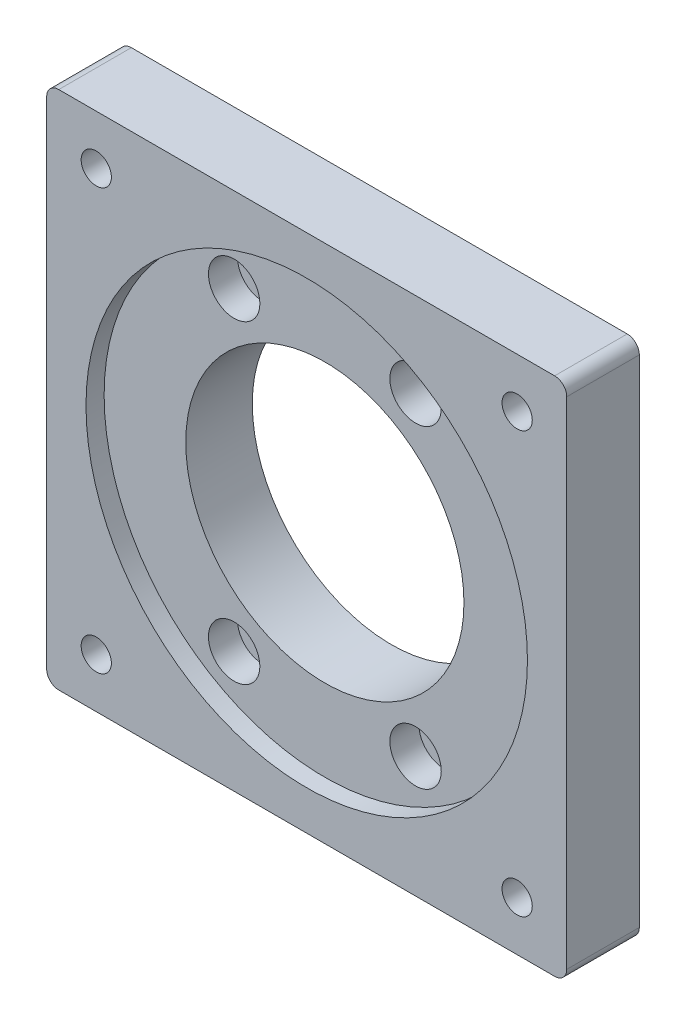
ISO-10303-21;
HEADER;
FILE_DESCRIPTION(('STEP AP214'),'2;1');
FILE_NAME('part.step','',(''),(''),'','','');
FILE_SCHEMA(('AUTOMOTIVE_DESIGN { 1 0 10303 214 1 1 1 1 }'));
ENDSEC;
DATA;
#1=APPLICATION_CONTEXT('core data for automotive mechanical design processes');
#2=APPLICATION_PROTOCOL_DEFINITION('international standard','automotive_design',2000,#1);
#3=PRODUCT_CONTEXT('',#1,'mechanical');
#4=PRODUCT('Part','Part','',(#3));
#5=PRODUCT_RELATED_PRODUCT_CATEGORY('part','',(#4));
#6=PRODUCT_DEFINITION_FORMATION('','',#4);
#7=PRODUCT_DEFINITION_CONTEXT('part definition',#1,'design');
#8=PRODUCT_DEFINITION('design','',#6,#7);
#9=PRODUCT_DEFINITION_SHAPE('','',#8);
#10=(LENGTH_UNIT() NAMED_UNIT(*) SI_UNIT(.MILLI.,.METRE.));
#11=(NAMED_UNIT(*) PLANE_ANGLE_UNIT() SI_UNIT($,.RADIAN.));
#12=(NAMED_UNIT(*) SI_UNIT($,.STERADIAN.) SOLID_ANGLE_UNIT());
#13=UNCERTAINTY_MEASURE_WITH_UNIT(LENGTH_MEASURE(1.E-05),#10,'distance_accuracy_value','');
#14=(GEOMETRIC_REPRESENTATION_CONTEXT(3) GLOBAL_UNCERTAINTY_ASSIGNED_CONTEXT((#13)) GLOBAL_UNIT_ASSIGNED_CONTEXT((#10,
#11,#12)) REPRESENTATION_CONTEXT('',''));
#15=CARTESIAN_POINT('',(0.,0.,0.));
#16=DIRECTION('',(0.,0.,1.));
#17=DIRECTION('',(1.,0.,0.));
#18=AXIS2_PLACEMENT_3D('',#15,#16,#17);
#19=CARTESIAN_POINT('',(0.,0.,0.));
#20=DIRECTION('',(0.,0.,-1.));
#21=DIRECTION('',(-1.,0.,0.));
#22=AXIS2_PLACEMENT_3D('',#19,#20,#21);
#23=PLANE('',#22);
#24=CARTESIAN_POINT('',(-34.8,-34.8,0.));
#25=DIRECTION('',(0.,0.,-1.));
#26=DIRECTION('',(-1.,0.,0.));
#27=AXIS2_PLACEMENT_3D('',#24,#25,#26);
#28=CIRCLE('',#27,2.49999999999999);
#29=CARTESIAN_POINT('',(-37.3,-34.8,0.));
#30=VERTEX_POINT('',#29);
#31=EDGE_CURVE('E265',#30,#30,#28,.T.);
#32=ORIENTED_EDGE('',*,*,#31,.F.);
#33=EDGE_LOOP('',(#32));
#34=FACE_BOUND('',#33,.T.);
#35=CARTESIAN_POINT('',(-34.8,34.8,0.));
#36=DIRECTION('',(0.,0.,-1.));
#37=DIRECTION('',(-1.,0.,0.));
#38=AXIS2_PLACEMENT_3D('',#35,#36,#37);
#39=CIRCLE('',#38,2.49999999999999);
#40=CARTESIAN_POINT('',(-37.3,34.8,0.));
#41=VERTEX_POINT('',#40);
#42=EDGE_CURVE('E259',#41,#41,#39,.T.);
#43=ORIENTED_EDGE('',*,*,#42,.F.);
#44=EDGE_LOOP('',(#43));
#45=FACE_BOUND('',#44,.T.);
#46=CARTESIAN_POINT('',(34.8,34.8,0.));
#47=DIRECTION('',(0.,0.,-1.));
#48=DIRECTION('',(-1.,0.,0.));
#49=AXIS2_PLACEMENT_3D('',#46,#47,#48);
#50=CIRCLE('',#49,2.49999999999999);
#51=CARTESIAN_POINT('',(32.3,34.8,0.));
#52=VERTEX_POINT('',#51);
#53=EDGE_CURVE('E253',#52,#52,#50,.T.);
#54=ORIENTED_EDGE('',*,*,#53,.F.);
#55=EDGE_LOOP('',(#54));
#56=FACE_BOUND('',#55,.T.);
#57=CARTESIAN_POINT('',(34.8,-34.8,0.));
#58=DIRECTION('',(0.,0.,-1.));
#59=DIRECTION('',(-1.,0.,0.));
#60=AXIS2_PLACEMENT_3D('',#57,#58,#59);
#61=CIRCLE('',#60,2.49999999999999);
#62=CARTESIAN_POINT('',(32.3,-34.8,0.));
#63=VERTEX_POINT('',#62);
#64=EDGE_CURVE('E247',#63,#63,#61,.T.);
#65=ORIENTED_EDGE('',*,*,#64,.F.);
#66=EDGE_LOOP('',(#65));
#67=FACE_BOUND('',#66,.T.);
#68=DIRECTION('',(0.,-1.,0.));
#69=VECTOR('',#68,1.);
#70=CARTESIAN_POINT('',(-43.,-43.,0.));
#71=LINE('',#70,#69);
#72=CARTESIAN_POINT('',(-43.,41.,0.));
#73=VERTEX_POINT('',#72);
#74=CARTESIAN_POINT('',(-43.,-41.,0.));
#75=VERTEX_POINT('',#74);
#76=EDGE_CURVE('E122',#73,#75,#71,.T.);
#77=ORIENTED_EDGE('',*,*,#76,.F.);
#78=CARTESIAN_POINT('',(-41.,41.,0.));
#79=DIRECTION('',(0.,0.,-1.));
#80=DIRECTION('',(-1.,0.,0.));
#81=AXIS2_PLACEMENT_3D('',#78,#79,#80);
#82=CIRCLE('',#81,2.);
#83=CARTESIAN_POINT('',(-41.,43.,0.));
#84=VERTEX_POINT('',#83);
#85=EDGE_CURVE('E105',#73,#84,#82,.T.);
#86=ORIENTED_EDGE('',*,*,#85,.T.);
#87=DIRECTION('',(-1.,0.,0.));
#88=VECTOR('',#87,1.);
#89=CARTESIAN_POINT('',(-43.,43.,0.));
#90=LINE('',#89,#88);
#91=CARTESIAN_POINT('',(41.,43.,0.));
#92=VERTEX_POINT('',#91);
#93=EDGE_CURVE('E131',#92,#84,#90,.T.);
#94=ORIENTED_EDGE('',*,*,#93,.F.);
#95=CARTESIAN_POINT('',(41.,41.,0.));
#96=DIRECTION('',(0.,0.,-1.));
#97=DIRECTION('',(-1.,0.,0.));
#98=AXIS2_PLACEMENT_3D('',#95,#96,#97);
#99=CIRCLE('',#98,2.);
#100=CARTESIAN_POINT('',(43.,41.,0.));
#101=VERTEX_POINT('',#100);
#102=EDGE_CURVE('E125',#92,#101,#99,.T.);
#103=ORIENTED_EDGE('',*,*,#102,.T.);
#104=DIRECTION('',(0.,1.,0.));
#105=VECTOR('',#104,1.);
#106=CARTESIAN_POINT('',(43.,-43.,0.));
#107=LINE('',#106,#105);
#108=CARTESIAN_POINT('',(43.,-41.,0.));
#109=VERTEX_POINT('',#108);
#110=EDGE_CURVE('E135',#109,#101,#107,.T.);
#111=ORIENTED_EDGE('',*,*,#110,.F.);
#112=CARTESIAN_POINT('',(41.,-41.,0.));
#113=DIRECTION('',(0.,0.,-1.));
#114=DIRECTION('',(-1.,0.,0.));
#115=AXIS2_PLACEMENT_3D('',#112,#113,#114);
#116=CIRCLE('',#115,2.);
#117=CARTESIAN_POINT('',(41.,-43.,0.));
#118=VERTEX_POINT('',#117);
#119=EDGE_CURVE('E166',#109,#118,#116,.T.);
#120=ORIENTED_EDGE('',*,*,#119,.T.);
#121=DIRECTION('',(1.,0.,0.));
#122=VECTOR('',#121,1.);
#123=CARTESIAN_POINT('',(-43.,-43.,0.));
#124=LINE('',#123,#122);
#125=CARTESIAN_POINT('',(-41.,-43.,0.));
#126=VERTEX_POINT('',#125);
#127=EDGE_CURVE('E130',#126,#118,#124,.T.);
#128=ORIENTED_EDGE('',*,*,#127,.F.);
#129=CARTESIAN_POINT('',(-41.,-41.,0.));
#130=DIRECTION('',(0.,0.,-1.));
#131=DIRECTION('',(-1.,0.,0.));
#132=AXIS2_PLACEMENT_3D('',#129,#130,#131);
#133=CIRCLE('',#132,2.);
#134=EDGE_CURVE('E116',#126,#75,#133,.T.);
#135=ORIENTED_EDGE('',*,*,#134,.T.);
#136=EDGE_LOOP('',(#77,#86,#94,#103,#111,#120,#128,#135));
#137=FACE_BOUND('',#136,.T.);
#138=CARTESIAN_POINT('',(-15.,25.9807621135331,0.));
#139=DIRECTION('',(0.,0.,1.));
#140=DIRECTION('',(1.,0.,0.));
#141=AXIS2_PLACEMENT_3D('',#138,#139,#140);
#142=CIRCLE('',#141,2.25);
#143=CARTESIAN_POINT('',(-12.75,25.9807621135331,0.));
#144=VERTEX_POINT('',#143);
#145=EDGE_CURVE('E208',#144,#144,#142,.T.);
#146=ORIENTED_EDGE('',*,*,#145,.T.);
#147=EDGE_LOOP('',(#146));
#148=FACE_BOUND('',#147,.T.);
#149=CARTESIAN_POINT('',(15.,25.9807621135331,0.));
#150=DIRECTION('',(0.,0.,1.));
#151=DIRECTION('',(1.,0.,0.));
#152=AXIS2_PLACEMENT_3D('',#149,#150,#151);
#153=CIRCLE('',#152,2.25);
#154=CARTESIAN_POINT('',(17.25,25.9807621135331,0.));
#155=VERTEX_POINT('',#154);
#156=EDGE_CURVE('E213',#155,#155,#153,.T.);
#157=ORIENTED_EDGE('',*,*,#156,.T.);
#158=EDGE_LOOP('',(#157));
#159=FACE_BOUND('',#158,.T.);
#160=CARTESIAN_POINT('',(15.,-25.9807621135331,0.));
#161=DIRECTION('',(0.,0.,1.));
#162=DIRECTION('',(1.,0.,0.));
#163=AXIS2_PLACEMENT_3D('',#160,#161,#162);
#164=CIRCLE('',#163,2.25);
#165=CARTESIAN_POINT('',(17.25,-25.9807621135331,0.));
#166=VERTEX_POINT('',#165);
#167=EDGE_CURVE('E216',#166,#166,#164,.T.);
#168=ORIENTED_EDGE('',*,*,#167,.T.);
#169=EDGE_LOOP('',(#168));
#170=FACE_BOUND('',#169,.T.);
#171=CARTESIAN_POINT('',(-15.,-25.9807621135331,0.));
#172=DIRECTION('',(0.,0.,1.));
#173=DIRECTION('',(1.,0.,0.));
#174=AXIS2_PLACEMENT_3D('',#171,#172,#173);
#175=CIRCLE('',#174,2.25);
#176=CARTESIAN_POINT('',(-12.75,-25.9807621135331,0.));
#177=VERTEX_POINT('',#176);
#178=EDGE_CURVE('E146',#177,#177,#175,.T.);
#179=ORIENTED_EDGE('',*,*,#178,.T.);
#180=EDGE_LOOP('',(#179));
#181=FACE_BOUND('',#180,.T.);
#182=CARTESIAN_POINT('',(0.,0.,0.));
#183=DIRECTION('',(0.,0.,-1.));
#184=DIRECTION('',(-1.,0.,0.));
#185=AXIS2_PLACEMENT_3D('',#182,#183,#184);
#186=CIRCLE('',#185,25.);
#187=CARTESIAN_POINT('',(-25.,0.,0.));
#188=VERTEX_POINT('',#187);
#189=EDGE_CURVE('E239',#188,#188,#186,.T.);
#190=ORIENTED_EDGE('',*,*,#189,.F.);
#191=EDGE_LOOP('',(#190));
#192=FACE_BOUND('',#191,.T.);
#193=ADVANCED_FACE('F38',(#34,#45,#56,#67,#137,#148,#159,#170,#181,#192),#23,.T.);
#194=CARTESIAN_POINT('',(-15.,-25.9807621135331,0.));
#195=DIRECTION('',(0.,0.,1.));
#196=DIRECTION('',(1.,0.,0.));
#197=AXIS2_PLACEMENT_3D('',#194,#195,#196);
#198=CYLINDRICAL_SURFACE('',#197,2.25);
#199=ORIENTED_EDGE('',*,*,#178,.F.);
#200=EDGE_LOOP('',(#199));
#201=FACE_BOUND('',#200,.T.);
#202=CARTESIAN_POINT('',(-15.,-25.9807621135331,4.2));
#203=DIRECTION('',(0.,0.,1.));
#204=DIRECTION('',(1.,0.,0.));
#205=AXIS2_PLACEMENT_3D('',#202,#203,#204);
#206=CIRCLE('',#205,2.25);
#207=CARTESIAN_POINT('',(-12.75,-25.9807621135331,4.2));
#208=VERTEX_POINT('',#207);
#209=EDGE_CURVE('E158',#208,#208,#206,.F.);
#210=ORIENTED_EDGE('',*,*,#209,.F.);
#211=EDGE_LOOP('',(#210));
#212=FACE_BOUND('',#211,.T.);
#213=ADVANCED_FACE('F303',(#201,#212),#198,.F.);
#214=CARTESIAN_POINT('',(15.,-25.9807621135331,0.));
#215=DIRECTION('',(0.,0.,1.));
#216=DIRECTION('',(1.,0.,0.));
#217=AXIS2_PLACEMENT_3D('',#214,#215,#216);
#218=CYLINDRICAL_SURFACE('',#217,2.25);
#219=ORIENTED_EDGE('',*,*,#167,.F.);
#220=EDGE_LOOP('',(#219));
#221=FACE_BOUND('',#220,.T.);
#222=CARTESIAN_POINT('',(15.,-25.9807621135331,4.2));
#223=DIRECTION('',(0.,0.,1.));
#224=DIRECTION('',(1.,0.,0.));
#225=AXIS2_PLACEMENT_3D('',#222,#223,#224);
#226=CIRCLE('',#225,2.25);
#227=CARTESIAN_POINT('',(17.25,-25.9807621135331,4.2));
#228=VERTEX_POINT('',#227);
#229=EDGE_CURVE('E153',#228,#228,#226,.F.);
#230=ORIENTED_EDGE('',*,*,#229,.F.);
#231=EDGE_LOOP('',(#230));
#232=FACE_BOUND('',#231,.T.);
#233=ADVANCED_FACE('F309',(#221,#232),#218,.F.);
#234=CARTESIAN_POINT('',(15.,25.9807621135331,0.));
#235=DIRECTION('',(0.,0.,1.));
#236=DIRECTION('',(1.,0.,0.));
#237=AXIS2_PLACEMENT_3D('',#234,#235,#236);
#238=CYLINDRICAL_SURFACE('',#237,2.25);
#239=ORIENTED_EDGE('',*,*,#156,.F.);
#240=EDGE_LOOP('',(#239));
#241=FACE_BOUND('',#240,.T.);
#242=CARTESIAN_POINT('',(15.,25.9807621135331,4.2));
#243=DIRECTION('',(0.,0.,1.));
#244=DIRECTION('',(1.,0.,0.));
#245=AXIS2_PLACEMENT_3D('',#242,#243,#244);
#246=CIRCLE('',#245,2.25);
#247=CARTESIAN_POINT('',(17.25,25.9807621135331,4.2));
#248=VERTEX_POINT('',#247);
#249=EDGE_CURVE('E148',#248,#248,#246,.F.);
#250=ORIENTED_EDGE('',*,*,#249,.F.);
#251=EDGE_LOOP('',(#250));
#252=FACE_BOUND('',#251,.T.);
#253=ADVANCED_FACE('F382',(#241,#252),#238,.F.);
#254=CARTESIAN_POINT('',(-15.,25.9807621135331,0.));
#255=DIRECTION('',(0.,0.,1.));
#256=DIRECTION('',(1.,0.,0.));
#257=AXIS2_PLACEMENT_3D('',#254,#255,#256);
#258=CYLINDRICAL_SURFACE('',#257,2.25);
#259=ORIENTED_EDGE('',*,*,#145,.F.);
#260=EDGE_LOOP('',(#259));
#261=FACE_BOUND('',#260,.T.);
#262=CARTESIAN_POINT('',(-15.,25.9807621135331,4.2));
#263=DIRECTION('',(0.,0.,1.));
#264=DIRECTION('',(1.,0.,0.));
#265=AXIS2_PLACEMENT_3D('',#262,#263,#264);
#266=CIRCLE('',#265,2.25);
#267=CARTESIAN_POINT('',(-12.75,25.9807621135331,4.2));
#268=VERTEX_POINT('',#267);
#269=EDGE_CURVE('E143',#268,#268,#266,.F.);
#270=ORIENTED_EDGE('',*,*,#269,.F.);
#271=EDGE_LOOP('',(#270));
#272=FACE_BOUND('',#271,.T.);
#273=ADVANCED_FACE('F386',(#261,#272),#258,.F.);
#274=CARTESIAN_POINT('',(0.,0.,12.));
#275=DIRECTION('',(0.,0.,-1.));
#276=DIRECTION('',(-1.,0.,0.));
#277=AXIS2_PLACEMENT_3D('',#274,#275,#276);
#278=CYLINDRICAL_SURFACE('',#277,23.);
#279=CARTESIAN_POINT('',(0.,0.,9.));
#280=DIRECTION('',(0.,0.,1.));
#281=DIRECTION('',(1.,0.,0.));
#282=AXIS2_PLACEMENT_3D('',#279,#280,#281);
#283=CIRCLE('',#282,23.);
#284=CARTESIAN_POINT('',(23.,0.,9.));
#285=VERTEX_POINT('',#284);
#286=EDGE_CURVE('E139',#285,#285,#283,.T.);
#287=ORIENTED_EDGE('',*,*,#286,.T.);
#288=EDGE_LOOP('',(#287));
#289=FACE_BOUND('',#288,.T.);
#290=CARTESIAN_POINT('',(0.,0.,-2.));
#291=DIRECTION('',(0.,0.,-1.));
#292=DIRECTION('',(-1.,0.,0.));
#293=AXIS2_PLACEMENT_3D('',#290,#291,#292);
#294=CIRCLE('',#293,23.);
#295=CARTESIAN_POINT('',(-23.,0.,-2.));
#296=VERTEX_POINT('',#295);
#297=EDGE_CURVE('E242',#296,#296,#294,.T.);
#298=ORIENTED_EDGE('',*,*,#297,.T.);
#299=EDGE_LOOP('',(#298));
#300=FACE_BOUND('',#299,.T.);
#301=ADVANCED_FACE('F276',(#289,#300),#278,.F.);
#302=CARTESIAN_POINT('',(0.,0.,12.));
#303=DIRECTION('',(0.,0.,-1.));
#304=DIRECTION('',(-1.,0.,0.));
#305=AXIS2_PLACEMENT_3D('',#302,#303,#304);
#306=PLANE('',#305);
#307=CARTESIAN_POINT('',(-34.8,-34.8,12.));
#308=DIRECTION('',(0.,0.,1.));
#309=DIRECTION('',(1.,0.,0.));
#310=AXIS2_PLACEMENT_3D('',#307,#308,#309);
#311=CIRCLE('',#310,2.49999999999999);
#312=CARTESIAN_POINT('',(-32.3,-34.8,12.));
#313=VERTEX_POINT('',#312);
#314=EDGE_CURVE('E268',#313,#313,#311,.T.);
#315=ORIENTED_EDGE('',*,*,#314,.F.);
#316=EDGE_LOOP('',(#315));
#317=FACE_BOUND('',#316,.T.);
#318=CARTESIAN_POINT('',(-34.8,34.8,12.));
#319=DIRECTION('',(0.,0.,1.));
#320=DIRECTION('',(1.,0.,0.));
#321=AXIS2_PLACEMENT_3D('',#318,#319,#320);
#322=CIRCLE('',#321,2.49999999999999);
#323=CARTESIAN_POINT('',(-32.3,34.8,12.));
#324=VERTEX_POINT('',#323);
#325=EDGE_CURVE('E262',#324,#324,#322,.T.);
#326=ORIENTED_EDGE('',*,*,#325,.F.);
#327=EDGE_LOOP('',(#326));
#328=FACE_BOUND('',#327,.T.);
#329=CARTESIAN_POINT('',(34.8,34.8,12.));
#330=DIRECTION('',(0.,0.,1.));
#331=DIRECTION('',(1.,0.,0.));
#332=AXIS2_PLACEMENT_3D('',#329,#330,#331);
#333=CIRCLE('',#332,2.49999999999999);
#334=CARTESIAN_POINT('',(37.3,34.8,12.));
#335=VERTEX_POINT('',#334);
#336=EDGE_CURVE('E256',#335,#335,#333,.T.);
#337=ORIENTED_EDGE('',*,*,#336,.F.);
#338=EDGE_LOOP('',(#337));
#339=FACE_BOUND('',#338,.T.);
#340=CARTESIAN_POINT('',(34.8,-34.8,12.));
#341=DIRECTION('',(0.,0.,1.));
#342=DIRECTION('',(1.,0.,0.));
#343=AXIS2_PLACEMENT_3D('',#340,#341,#342);
#344=CIRCLE('',#343,2.49999999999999);
#345=CARTESIAN_POINT('',(37.3,-34.8,12.));
#346=VERTEX_POINT('',#345);
#347=EDGE_CURVE('E250',#346,#346,#344,.T.);
#348=ORIENTED_EDGE('',*,*,#347,.F.);
#349=EDGE_LOOP('',(#348));
#350=FACE_BOUND('',#349,.T.);
#351=CARTESIAN_POINT('',(0.,0.,12.));
#352=DIRECTION('',(0.,0.,1.));
#353=DIRECTION('',(1.,0.,0.));
#354=AXIS2_PLACEMENT_3D('',#351,#352,#353);
#355=CIRCLE('',#354,36.5);
#356=CARTESIAN_POINT('',(36.5,0.,12.));
#357=VERTEX_POINT('',#356);
#358=EDGE_CURVE('E205',#357,#357,#355,.T.);
#359=ORIENTED_EDGE('',*,*,#358,.F.);
#360=EDGE_LOOP('',(#359));
#361=FACE_BOUND('',#360,.T.);
#362=DIRECTION('',(-1.,0.,0.));
#363=VECTOR('',#362,1.);
#364=CARTESIAN_POINT('',(-43.,43.,12.));
#365=LINE('',#364,#363);
#366=CARTESIAN_POINT('',(41.,43.,12.));
#367=VERTEX_POINT('',#366);
#368=CARTESIAN_POINT('',(-41.,43.,12.));
#369=VERTEX_POINT('',#368);
#370=EDGE_CURVE('E196',#367,#369,#365,.T.);
#371=ORIENTED_EDGE('',*,*,#370,.T.);
#372=CARTESIAN_POINT('',(-41.,41.,12.));
#373=DIRECTION('',(0.,0.,-1.));
#374=DIRECTION('',(-1.,0.,0.));
#375=AXIS2_PLACEMENT_3D('',#372,#373,#374);
#376=CIRCLE('',#375,2.);
#377=CARTESIAN_POINT('',(-43.,41.,12.));
#378=VERTEX_POINT('',#377);
#379=EDGE_CURVE('E177',#369,#378,#376,.F.);
#380=ORIENTED_EDGE('',*,*,#379,.T.);
#381=DIRECTION('',(0.,-1.,0.));
#382=VECTOR('',#381,1.);
#383=CARTESIAN_POINT('',(-43.,-43.,12.));
#384=LINE('',#383,#382);
#385=CARTESIAN_POINT('',(-43.,-41.,12.));
#386=VERTEX_POINT('',#385);
#387=EDGE_CURVE('E124',#378,#386,#384,.T.);
#388=ORIENTED_EDGE('',*,*,#387,.T.);
#389=CARTESIAN_POINT('',(-41.,-41.,12.));
#390=DIRECTION('',(0.,0.,-1.));
#391=DIRECTION('',(-1.,0.,0.));
#392=AXIS2_PLACEMENT_3D('',#389,#390,#391);
#393=CIRCLE('',#392,2.);
#394=CARTESIAN_POINT('',(-41.,-43.,12.));
#395=VERTEX_POINT('',#394);
#396=EDGE_CURVE('E60',#386,#395,#393,.F.);
#397=ORIENTED_EDGE('',*,*,#396,.T.);
#398=DIRECTION('',(1.,0.,0.));
#399=VECTOR('',#398,1.);
#400=CARTESIAN_POINT('',(-43.,-43.,12.));
#401=LINE('',#400,#399);
#402=CARTESIAN_POINT('',(41.,-43.,12.));
#403=VERTEX_POINT('',#402);
#404=EDGE_CURVE('E163',#395,#403,#401,.T.);
#405=ORIENTED_EDGE('',*,*,#404,.T.);
#406=CARTESIAN_POINT('',(41.,-41.,12.));
#407=DIRECTION('',(0.,0.,-1.));
#408=DIRECTION('',(-1.,0.,0.));
#409=AXIS2_PLACEMENT_3D('',#406,#407,#408);
#410=CIRCLE('',#409,2.);
#411=CARTESIAN_POINT('',(43.,-41.,12.));
#412=VERTEX_POINT('',#411);
#413=EDGE_CURVE('E174',#403,#412,#410,.F.);
#414=ORIENTED_EDGE('',*,*,#413,.T.);
#415=DIRECTION('',(0.,1.,0.));
#416=VECTOR('',#415,1.);
#417=CARTESIAN_POINT('',(43.,-43.,12.));
#418=LINE('',#417,#416);
#419=CARTESIAN_POINT('',(43.,41.,12.));
#420=VERTEX_POINT('',#419);
#421=EDGE_CURVE('E133',#412,#420,#418,.T.);
#422=ORIENTED_EDGE('',*,*,#421,.T.);
#423=CARTESIAN_POINT('',(41.,41.,12.));
#424=DIRECTION('',(0.,0.,-1.));
#425=DIRECTION('',(-1.,0.,0.));
#426=AXIS2_PLACEMENT_3D('',#423,#424,#425);
#427=CIRCLE('',#426,2.);
#428=EDGE_CURVE('E172',#420,#367,#427,.F.);
#429=ORIENTED_EDGE('',*,*,#428,.T.);
#430=EDGE_LOOP('',(#371,#380,#388,#397,#405,#414,#422,#429));
#431=FACE_BOUND('',#430,.T.);
#432=ADVANCED_FACE('F193',(#317,#328,#339,#350,#361,#431),#306,.F.);
#433=CARTESIAN_POINT('',(43.,-43.,12.));
#434=DIRECTION('',(-1.,0.,0.));
#435=DIRECTION('',(0.,0.,1.));
#436=AXIS2_PLACEMENT_3D('',#433,#434,#435);
#437=PLANE('',#436);
#438=ORIENTED_EDGE('',*,*,#421,.F.);
#439=DIRECTION('',(0.,0.,-1.));
#440=VECTOR('',#439,1.);
#441=CARTESIAN_POINT('',(43.,-41.,12.));
#442=LINE('',#441,#440);
#443=EDGE_CURVE('E11',#412,#109,#442,.T.);
#444=ORIENTED_EDGE('',*,*,#443,.T.);
#445=ORIENTED_EDGE('',*,*,#110,.T.);
#446=DIRECTION('',(0.,0.,-1.));
#447=VECTOR('',#446,1.);
#448=CARTESIAN_POINT('',(43.,41.,12.));
#449=LINE('',#448,#447);
#450=EDGE_CURVE('E46',#101,#420,#449,.F.);
#451=ORIENTED_EDGE('',*,*,#450,.T.);
#452=EDGE_LOOP('',(#438,#444,#445,#451));
#453=FACE_BOUND('',#452,.T.);
#454=ADVANCED_FACE('F187',(#453),#437,.F.);
#455=CARTESIAN_POINT('',(-43.,43.,12.));
#456=DIRECTION('',(0.,-1.,0.));
#457=DIRECTION('',(0.,0.,-1.));
#458=AXIS2_PLACEMENT_3D('',#455,#456,#457);
#459=PLANE('',#458);
#460=ORIENTED_EDGE('',*,*,#93,.T.);
#461=DIRECTION('',(0.,0.,-1.));
#462=VECTOR('',#461,1.);
#463=CARTESIAN_POINT('',(-41.,43.,12.));
#464=LINE('',#463,#462);
#465=EDGE_CURVE('E110',#84,#369,#464,.F.);
#466=ORIENTED_EDGE('',*,*,#465,.T.);
#467=ORIENTED_EDGE('',*,*,#370,.F.);
#468=DIRECTION('',(0.,0.,-1.));
#469=VECTOR('',#468,1.);
#470=CARTESIAN_POINT('',(41.,43.,12.));
#471=LINE('',#470,#469);
#472=EDGE_CURVE('E115',#367,#92,#471,.T.);
#473=ORIENTED_EDGE('',*,*,#472,.T.);
#474=EDGE_LOOP('',(#460,#466,#467,#473));
#475=FACE_BOUND('',#474,.T.);
#476=ADVANCED_FACE('F200',(#475),#459,.F.);
#477=CARTESIAN_POINT('',(-43.,-43.,12.));
#478=DIRECTION('',(1.,0.,0.));
#479=DIRECTION('',(0.,0.,-1.));
#480=AXIS2_PLACEMENT_3D('',#477,#478,#479);
#481=PLANE('',#480);
#482=ORIENTED_EDGE('',*,*,#387,.F.);
#483=DIRECTION('',(0.,0.,-1.));
#484=VECTOR('',#483,1.);
#485=CARTESIAN_POINT('',(-43.,41.,12.));
#486=LINE('',#485,#484);
#487=EDGE_CURVE('E109',#378,#73,#486,.T.);
#488=ORIENTED_EDGE('',*,*,#487,.T.);
#489=ORIENTED_EDGE('',*,*,#76,.T.);
#490=DIRECTION('',(0.,0.,-1.));
#491=VECTOR('',#490,1.);
#492=CARTESIAN_POINT('',(-43.,-41.,12.));
#493=LINE('',#492,#491);
#494=EDGE_CURVE('E126',#75,#386,#493,.F.);
#495=ORIENTED_EDGE('',*,*,#494,.T.);
#496=EDGE_LOOP('',(#482,#488,#489,#495));
#497=FACE_BOUND('',#496,.T.);
#498=ADVANCED_FACE('F121',(#497),#481,.F.);
#499=CARTESIAN_POINT('',(-43.,-43.,12.));
#500=DIRECTION('',(0.,1.,0.));
#501=DIRECTION('',(0.,0.,1.));
#502=AXIS2_PLACEMENT_3D('',#499,#500,#501);
#503=PLANE('',#502);
#504=ORIENTED_EDGE('',*,*,#404,.F.);
#505=DIRECTION('',(0.,0.,-1.));
#506=VECTOR('',#505,1.);
#507=CARTESIAN_POINT('',(-41.,-43.,12.));
#508=LINE('',#507,#506);
#509=EDGE_CURVE('E180',#395,#126,#508,.T.);
#510=ORIENTED_EDGE('',*,*,#509,.T.);
#511=ORIENTED_EDGE('',*,*,#127,.T.);
#512=DIRECTION('',(0.,0.,-1.));
#513=VECTOR('',#512,1.);
#514=CARTESIAN_POINT('',(41.,-43.,12.));
#515=LINE('',#514,#513);
#516=EDGE_CURVE('E53',#118,#403,#515,.F.);
#517=ORIENTED_EDGE('',*,*,#516,.T.);
#518=EDGE_LOOP('',(#504,#510,#511,#517));
#519=FACE_BOUND('',#518,.T.);
#520=ADVANCED_FACE('F289',(#519),#503,.F.);
#521=CARTESIAN_POINT('',(0.,0.,9.));
#522=DIRECTION('',(0.,0.,1.));
#523=DIRECTION('',(1.,0.,0.));
#524=AXIS2_PLACEMENT_3D('',#521,#522,#523);
#525=CYLINDRICAL_SURFACE('',#524,36.5);
#526=CARTESIAN_POINT('',(0.,0.,9.));
#527=DIRECTION('',(0.,0.,1.));
#528=DIRECTION('',(1.,0.,0.));
#529=AXIS2_PLACEMENT_3D('',#526,#527,#528);
#530=CIRCLE('',#529,36.5);
#531=CARTESIAN_POINT('',(36.5,0.,9.));
#532=VERTEX_POINT('',#531);
#533=EDGE_CURVE('E142',#532,#532,#530,.T.);
#534=ORIENTED_EDGE('',*,*,#533,.F.);
#535=EDGE_LOOP('',(#534));
#536=FACE_BOUND('',#535,.T.);
#537=ORIENTED_EDGE('',*,*,#358,.T.);
#538=EDGE_LOOP('',(#537));
#539=FACE_BOUND('',#538,.T.);
#540=ADVANCED_FACE('F286',(#536,#539),#525,.F.);
#541=CARTESIAN_POINT('',(0.,0.,9.));
#542=DIRECTION('',(0.,0.,1.));
#543=DIRECTION('',(1.,0.,0.));
#544=AXIS2_PLACEMENT_3D('',#541,#542,#543);
#545=PLANE('',#544);
#546=CARTESIAN_POINT('',(-15.,-25.9807621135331,9.));
#547=DIRECTION('',(0.,0.,1.));
#548=DIRECTION('',(1.,0.,0.));
#549=AXIS2_PLACEMENT_3D('',#546,#547,#548);
#550=CIRCLE('',#549,4.25);
#551=CARTESIAN_POINT('',(-10.75,-25.9807621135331,9.));
#552=VERTEX_POINT('',#551);
#553=EDGE_CURVE('E233',#552,#552,#550,.T.);
#554=ORIENTED_EDGE('',*,*,#553,.F.);
#555=EDGE_LOOP('',(#554));
#556=FACE_BOUND('',#555,.T.);
#557=CARTESIAN_POINT('',(15.,-25.9807621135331,9.));
#558=DIRECTION('',(0.,0.,1.));
#559=DIRECTION('',(1.,0.,0.));
#560=AXIS2_PLACEMENT_3D('',#557,#558,#559);
#561=CIRCLE('',#560,4.25);
#562=CARTESIAN_POINT('',(19.25,-25.9807621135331,9.));
#563=VERTEX_POINT('',#562);
#564=EDGE_CURVE('E161',#563,#563,#561,.T.);
#565=ORIENTED_EDGE('',*,*,#564,.F.);
#566=EDGE_LOOP('',(#565));
#567=FACE_BOUND('',#566,.T.);
#568=CARTESIAN_POINT('',(15.,25.9807621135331,9.));
#569=DIRECTION('',(0.,0.,1.));
#570=DIRECTION('',(1.,0.,0.));
#571=AXIS2_PLACEMENT_3D('',#568,#569,#570);
#572=CIRCLE('',#571,4.25);
#573=CARTESIAN_POINT('',(19.25,25.9807621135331,9.));
#574=VERTEX_POINT('',#573);
#575=EDGE_CURVE('E156',#574,#574,#572,.T.);
#576=ORIENTED_EDGE('',*,*,#575,.F.);
#577=EDGE_LOOP('',(#576));
#578=FACE_BOUND('',#577,.T.);
#579=CARTESIAN_POINT('',(-15.,25.9807621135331,9.));
#580=DIRECTION('',(0.,0.,1.));
#581=DIRECTION('',(1.,0.,0.));
#582=AXIS2_PLACEMENT_3D('',#579,#580,#581);
#583=CIRCLE('',#582,4.25);
#584=CARTESIAN_POINT('',(-10.75,25.9807621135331,9.));
#585=VERTEX_POINT('',#584);
#586=EDGE_CURVE('E151',#585,#585,#583,.T.);
#587=ORIENTED_EDGE('',*,*,#586,.F.);
#588=EDGE_LOOP('',(#587));
#589=FACE_BOUND('',#588,.T.);
#590=ORIENTED_EDGE('',*,*,#286,.F.);
#591=EDGE_LOOP('',(#590));
#592=FACE_BOUND('',#591,.T.);
#593=ORIENTED_EDGE('',*,*,#533,.T.);
#594=EDGE_LOOP('',(#593));
#595=FACE_BOUND('',#594,.T.);
#596=ADVANCED_FACE('F288',(#556,#567,#578,#589,#592,#595),#545,.T.);
#597=CARTESIAN_POINT('',(-15.,25.9807621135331,4.2));
#598=DIRECTION('',(0.,0.,1.));
#599=DIRECTION('',(1.,0.,0.));
#600=AXIS2_PLACEMENT_3D('',#597,#598,#599);
#601=PLANE('',#600);
#602=CARTESIAN_POINT('',(-15.,25.9807621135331,4.2));
#603=DIRECTION('',(0.,0.,1.));
#604=DIRECTION('',(1.,0.,0.));
#605=AXIS2_PLACEMENT_3D('',#602,#603,#604);
#606=CIRCLE('',#605,4.25);
#607=CARTESIAN_POINT('',(-10.75,25.9807621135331,4.2));
#608=VERTEX_POINT('',#607);
#609=EDGE_CURVE('E147',#608,#608,#606,.T.);
#610=ORIENTED_EDGE('',*,*,#609,.T.);
#611=EDGE_LOOP('',(#610));
#612=FACE_BOUND('',#611,.T.);
#613=ORIENTED_EDGE('',*,*,#269,.T.);
#614=EDGE_LOOP('',(#613));
#615=FACE_BOUND('',#614,.T.);
#616=ADVANCED_FACE('F296',(#612,#615),#601,.T.);
#617=CARTESIAN_POINT('',(-15.,25.9807621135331,4.2));
#618=DIRECTION('',(0.,0.,1.));
#619=DIRECTION('',(1.,0.,0.));
#620=AXIS2_PLACEMENT_3D('',#617,#618,#619);
#621=CYLINDRICAL_SURFACE('',#620,4.25);
#622=ORIENTED_EDGE('',*,*,#609,.F.);
#623=EDGE_LOOP('',(#622));
#624=FACE_BOUND('',#623,.T.);
#625=ORIENTED_EDGE('',*,*,#586,.T.);
#626=EDGE_LOOP('',(#625));
#627=FACE_BOUND('',#626,.T.);
#628=ADVANCED_FACE('F369',(#624,#627),#621,.F.);
#629=CARTESIAN_POINT('',(15.,25.9807621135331,4.2));
#630=DIRECTION('',(0.,0.,1.));
#631=DIRECTION('',(1.,0.,0.));
#632=AXIS2_PLACEMENT_3D('',#629,#630,#631);
#633=PLANE('',#632);
#634=CARTESIAN_POINT('',(15.,25.9807621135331,4.2));
#635=DIRECTION('',(0.,0.,1.));
#636=DIRECTION('',(1.,0.,0.));
#637=AXIS2_PLACEMENT_3D('',#634,#635,#636);
#638=CIRCLE('',#637,4.25);
#639=CARTESIAN_POINT('',(19.25,25.9807621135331,4.2));
#640=VERTEX_POINT('',#639);
#641=EDGE_CURVE('E152',#640,#640,#638,.T.);
#642=ORIENTED_EDGE('',*,*,#641,.T.);
#643=EDGE_LOOP('',(#642));
#644=FACE_BOUND('',#643,.T.);
#645=ORIENTED_EDGE('',*,*,#249,.T.);
#646=EDGE_LOOP('',(#645));
#647=FACE_BOUND('',#646,.T.);
#648=ADVANCED_FACE('F366',(#644,#647),#633,.T.);
#649=CARTESIAN_POINT('',(15.,25.9807621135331,4.2));
#650=DIRECTION('',(0.,0.,1.));
#651=DIRECTION('',(1.,0.,0.));
#652=AXIS2_PLACEMENT_3D('',#649,#650,#651);
#653=CYLINDRICAL_SURFACE('',#652,4.25);
#654=ORIENTED_EDGE('',*,*,#641,.F.);
#655=EDGE_LOOP('',(#654));
#656=FACE_BOUND('',#655,.T.);
#657=ORIENTED_EDGE('',*,*,#575,.T.);
#658=EDGE_LOOP('',(#657));
#659=FACE_BOUND('',#658,.T.);
#660=ADVANCED_FACE('F361',(#656,#659),#653,.F.);
#661=CARTESIAN_POINT('',(15.,-25.9807621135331,4.2));
#662=DIRECTION('',(0.,0.,1.));
#663=DIRECTION('',(1.,0.,0.));
#664=AXIS2_PLACEMENT_3D('',#661,#662,#663);
#665=PLANE('',#664);
#666=CARTESIAN_POINT('',(15.,-25.9807621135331,4.2));
#667=DIRECTION('',(0.,0.,1.));
#668=DIRECTION('',(1.,0.,0.));
#669=AXIS2_PLACEMENT_3D('',#666,#667,#668);
#670=CIRCLE('',#669,4.25);
#671=CARTESIAN_POINT('',(19.25,-25.9807621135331,4.2));
#672=VERTEX_POINT('',#671);
#673=EDGE_CURVE('E157',#672,#672,#670,.T.);
#674=ORIENTED_EDGE('',*,*,#673,.T.);
#675=EDGE_LOOP('',(#674));
#676=FACE_BOUND('',#675,.T.);
#677=ORIENTED_EDGE('',*,*,#229,.T.);
#678=EDGE_LOOP('',(#677));
#679=FACE_BOUND('',#678,.T.);
#680=ADVANCED_FACE('F358',(#676,#679),#665,.T.);
#681=CARTESIAN_POINT('',(15.,-25.9807621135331,4.2));
#682=DIRECTION('',(0.,0.,1.));
#683=DIRECTION('',(1.,0.,0.));
#684=AXIS2_PLACEMENT_3D('',#681,#682,#683);
#685=CYLINDRICAL_SURFACE('',#684,4.25);
#686=ORIENTED_EDGE('',*,*,#673,.F.);
#687=EDGE_LOOP('',(#686));
#688=FACE_BOUND('',#687,.T.);
#689=ORIENTED_EDGE('',*,*,#564,.T.);
#690=EDGE_LOOP('',(#689));
#691=FACE_BOUND('',#690,.T.);
#692=ADVANCED_FACE('F353',(#688,#691),#685,.F.);
#693=CARTESIAN_POINT('',(-15.,-25.9807621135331,4.2));
#694=DIRECTION('',(0.,0.,1.));
#695=DIRECTION('',(1.,0.,0.));
#696=AXIS2_PLACEMENT_3D('',#693,#694,#695);
#697=PLANE('',#696);
#698=CARTESIAN_POINT('',(-15.,-25.9807621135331,4.2));
#699=DIRECTION('',(0.,0.,1.));
#700=DIRECTION('',(1.,0.,0.));
#701=AXIS2_PLACEMENT_3D('',#698,#699,#700);
#702=CIRCLE('',#701,4.25);
#703=CARTESIAN_POINT('',(-10.75,-25.9807621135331,4.2));
#704=VERTEX_POINT('',#703);
#705=EDGE_CURVE('E162',#704,#704,#702,.T.);
#706=ORIENTED_EDGE('',*,*,#705,.T.);
#707=EDGE_LOOP('',(#706));
#708=FACE_BOUND('',#707,.T.);
#709=ORIENTED_EDGE('',*,*,#209,.T.);
#710=EDGE_LOOP('',(#709));
#711=FACE_BOUND('',#710,.T.);
#712=ADVANCED_FACE('F350',(#708,#711),#697,.T.);
#713=CARTESIAN_POINT('',(-15.,-25.9807621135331,4.2));
#714=DIRECTION('',(0.,0.,1.));
#715=DIRECTION('',(1.,0.,0.));
#716=AXIS2_PLACEMENT_3D('',#713,#714,#715);
#717=CYLINDRICAL_SURFACE('',#716,4.25);
#718=ORIENTED_EDGE('',*,*,#705,.F.);
#719=EDGE_LOOP('',(#718));
#720=FACE_BOUND('',#719,.T.);
#721=ORIENTED_EDGE('',*,*,#553,.T.);
#722=EDGE_LOOP('',(#721));
#723=FACE_BOUND('',#722,.T.);
#724=ADVANCED_FACE('F324',(#720,#723),#717,.F.);
#725=CARTESIAN_POINT('',(-41.,41.,12.));
#726=DIRECTION('',(0.,0.,-1.));
#727=DIRECTION('',(-1.,0.,0.));
#728=AXIS2_PLACEMENT_3D('',#725,#726,#727);
#729=CYLINDRICAL_SURFACE('',#728,2.);
#730=ORIENTED_EDGE('',*,*,#379,.F.);
#731=ORIENTED_EDGE('',*,*,#465,.F.);
#732=ORIENTED_EDGE('',*,*,#85,.F.);
#733=ORIENTED_EDGE('',*,*,#487,.F.);
#734=EDGE_LOOP('',(#730,#731,#732,#733));
#735=FACE_BOUND('',#734,.T.);
#736=ADVANCED_FACE('F108',(#735),#729,.T.);
#737=CARTESIAN_POINT('',(-41.,-41.,12.));
#738=DIRECTION('',(0.,0.,-1.));
#739=DIRECTION('',(-1.,0.,0.));
#740=AXIS2_PLACEMENT_3D('',#737,#738,#739);
#741=CYLINDRICAL_SURFACE('',#740,2.);
#742=ORIENTED_EDGE('',*,*,#396,.F.);
#743=ORIENTED_EDGE('',*,*,#494,.F.);
#744=ORIENTED_EDGE('',*,*,#134,.F.);
#745=ORIENTED_EDGE('',*,*,#509,.F.);
#746=EDGE_LOOP('',(#742,#743,#744,#745));
#747=FACE_BOUND('',#746,.T.);
#748=ADVANCED_FACE('F323',(#747),#741,.T.);
#749=CARTESIAN_POINT('',(41.,-41.,12.));
#750=DIRECTION('',(0.,0.,-1.));
#751=DIRECTION('',(-1.,0.,0.));
#752=AXIS2_PLACEMENT_3D('',#749,#750,#751);
#753=CYLINDRICAL_SURFACE('',#752,2.);
#754=ORIENTED_EDGE('',*,*,#413,.F.);
#755=ORIENTED_EDGE('',*,*,#516,.F.);
#756=ORIENTED_EDGE('',*,*,#119,.F.);
#757=ORIENTED_EDGE('',*,*,#443,.F.);
#758=EDGE_LOOP('',(#754,#755,#756,#757));
#759=FACE_BOUND('',#758,.T.);
#760=ADVANCED_FACE('F326',(#759),#753,.T.);
#761=CARTESIAN_POINT('',(41.,41.,12.));
#762=DIRECTION('',(0.,0.,-1.));
#763=DIRECTION('',(-1.,0.,0.));
#764=AXIS2_PLACEMENT_3D('',#761,#762,#763);
#765=CYLINDRICAL_SURFACE('',#764,2.);
#766=ORIENTED_EDGE('',*,*,#428,.F.);
#767=ORIENTED_EDGE('',*,*,#450,.F.);
#768=ORIENTED_EDGE('',*,*,#102,.F.);
#769=ORIENTED_EDGE('',*,*,#472,.F.);
#770=EDGE_LOOP('',(#766,#767,#768,#769));
#771=FACE_BOUND('',#770,.T.);
#772=ADVANCED_FACE('F40',(#771),#765,.T.);
#773=CARTESIAN_POINT('',(0.,0.,-2.));
#774=DIRECTION('',(0.,0.,-1.));
#775=DIRECTION('',(-1.,0.,0.));
#776=AXIS2_PLACEMENT_3D('',#773,#774,#775);
#777=PLANE('',#776);
#778=CARTESIAN_POINT('',(0.,0.,-2.));
#779=DIRECTION('',(0.,0.,-1.));
#780=DIRECTION('',(-1.,0.,0.));
#781=AXIS2_PLACEMENT_3D('',#778,#779,#780);
#782=CIRCLE('',#781,25.);
#783=CARTESIAN_POINT('',(-25.,0.,-2.));
#784=VERTEX_POINT('',#783);
#785=EDGE_CURVE('E236',#784,#784,#782,.T.);
#786=ORIENTED_EDGE('',*,*,#785,.T.);
#787=EDGE_LOOP('',(#786));
#788=FACE_BOUND('',#787,.T.);
#789=ORIENTED_EDGE('',*,*,#297,.F.);
#790=EDGE_LOOP('',(#789));
#791=FACE_BOUND('',#790,.T.);
#792=ADVANCED_FACE('F333',(#788,#791),#777,.T.);
#793=CARTESIAN_POINT('',(0.,0.,-2.));
#794=DIRECTION('',(0.,0.,1.));
#795=DIRECTION('',(1.,0.,0.));
#796=AXIS2_PLACEMENT_3D('',#793,#794,#795);
#797=CYLINDRICAL_SURFACE('',#796,25.);
#798=ORIENTED_EDGE('',*,*,#785,.F.);
#799=EDGE_LOOP('',(#798));
#800=FACE_BOUND('',#799,.T.);
#801=ORIENTED_EDGE('',*,*,#189,.T.);
#802=EDGE_LOOP('',(#801));
#803=FACE_BOUND('',#802,.T.);
#804=ADVANCED_FACE('F337',(#800,#803),#797,.T.);
#805=CARTESIAN_POINT('',(34.8,-34.8,12.));
#806=DIRECTION('',(0.,0.,1.));
#807=DIRECTION('',(1.,0.,0.));
#808=AXIS2_PLACEMENT_3D('',#805,#806,#807);
#809=CYLINDRICAL_SURFACE('',#808,2.49999999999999);
#810=ORIENTED_EDGE('',*,*,#64,.T.);
#811=EDGE_LOOP('',(#810));
#812=FACE_BOUND('',#811,.T.);
#813=ORIENTED_EDGE('',*,*,#347,.T.);
#814=EDGE_LOOP('',(#813));
#815=FACE_BOUND('',#814,.T.);
#816=ADVANCED_FACE('F343',(#812,#815),#809,.F.);
#817=CARTESIAN_POINT('',(34.8,34.8,12.));
#818=DIRECTION('',(0.,0.,1.));
#819=DIRECTION('',(1.,0.,0.));
#820=AXIS2_PLACEMENT_3D('',#817,#818,#819);
#821=CYLINDRICAL_SURFACE('',#820,2.49999999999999);
#822=ORIENTED_EDGE('',*,*,#53,.T.);
#823=EDGE_LOOP('',(#822));
#824=FACE_BOUND('',#823,.T.);
#825=ORIENTED_EDGE('',*,*,#336,.T.);
#826=EDGE_LOOP('',(#825));
#827=FACE_BOUND('',#826,.T.);
#828=ADVANCED_FACE('F494',(#824,#827),#821,.F.);
#829=CARTESIAN_POINT('',(-34.8,34.8,12.));
#830=DIRECTION('',(0.,0.,1.));
#831=DIRECTION('',(1.,0.,0.));
#832=AXIS2_PLACEMENT_3D('',#829,#830,#831);
#833=CYLINDRICAL_SURFACE('',#832,2.49999999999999);
#834=ORIENTED_EDGE('',*,*,#42,.T.);
#835=EDGE_LOOP('',(#834));
#836=FACE_BOUND('',#835,.T.);
#837=ORIENTED_EDGE('',*,*,#325,.T.);
#838=EDGE_LOOP('',(#837));
#839=FACE_BOUND('',#838,.T.);
#840=ADVANCED_FACE('F503',(#836,#839),#833,.F.);
#841=CARTESIAN_POINT('',(-34.8,-34.8,12.));
#842=DIRECTION('',(0.,0.,1.));
#843=DIRECTION('',(1.,0.,0.));
#844=AXIS2_PLACEMENT_3D('',#841,#842,#843);
#845=CYLINDRICAL_SURFACE('',#844,2.49999999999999);
#846=ORIENTED_EDGE('',*,*,#31,.T.);
#847=EDGE_LOOP('',(#846));
#848=FACE_BOUND('',#847,.T.);
#849=ORIENTED_EDGE('',*,*,#314,.T.);
#850=EDGE_LOOP('',(#849));
#851=FACE_BOUND('',#850,.T.);
#852=ADVANCED_FACE('F272',(#848,#851),#845,.F.);
#853=CLOSED_SHELL('',(#193,#213,#233,#253,#273,#301,#432,#454,#476,#498,#520,#540,#596,#616,
#628,#648,#660,#680,#692,#712,#724,#736,#748,#760,#772,#792,#804,#816,#828,#840,#852));
#854=MANIFOLD_SOLID_BREP('B2',#853);
#855=ADVANCED_BREP_SHAPE_REPRESENTATION('',(#18,#854),#14);
#856=SHAPE_DEFINITION_REPRESENTATION(#9,#855);
ENDSEC;
END-ISO-10303-21;
